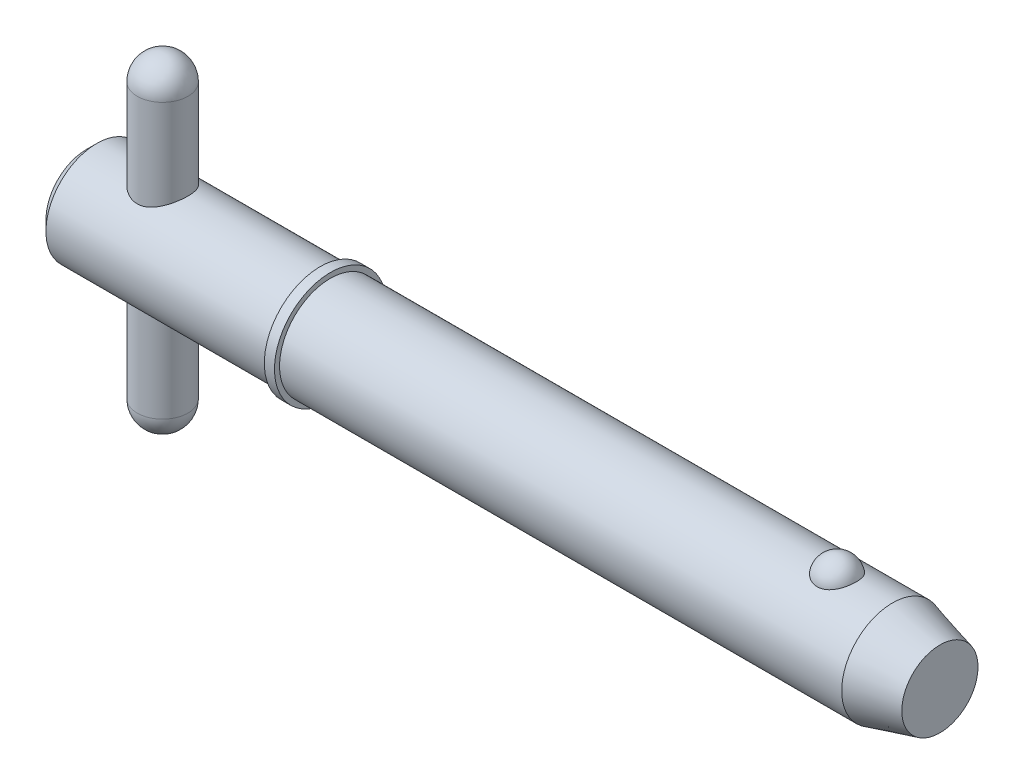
ISO-10303-21;
HEADER;
FILE_DESCRIPTION(('STEP AP214'),'2;1');
FILE_NAME('part.step','',(''),(''),'','','');
FILE_SCHEMA(('AUTOMOTIVE_DESIGN { 1 0 10303 214 1 1 1 1 }'));
ENDSEC;
DATA;
#1=APPLICATION_CONTEXT('core data for automotive mechanical design processes');
#2=APPLICATION_PROTOCOL_DEFINITION('international standard','automotive_design',2000,#1);
#3=PRODUCT_CONTEXT('',#1,'mechanical');
#4=PRODUCT('Part','Part','',(#3));
#5=PRODUCT_RELATED_PRODUCT_CATEGORY('part','',(#4));
#6=PRODUCT_DEFINITION_FORMATION('','',#4);
#7=PRODUCT_DEFINITION_CONTEXT('part definition',#1,'design');
#8=PRODUCT_DEFINITION('design','',#6,#7);
#9=PRODUCT_DEFINITION_SHAPE('','',#8);
#10=(LENGTH_UNIT() NAMED_UNIT(*) SI_UNIT(.MILLI.,.METRE.));
#11=(NAMED_UNIT(*) PLANE_ANGLE_UNIT() SI_UNIT($,.RADIAN.));
#12=(NAMED_UNIT(*) SI_UNIT($,.STERADIAN.) SOLID_ANGLE_UNIT());
#13=UNCERTAINTY_MEASURE_WITH_UNIT(LENGTH_MEASURE(1.E-05),#10,'distance_accuracy_value','');
#14=(GEOMETRIC_REPRESENTATION_CONTEXT(3) GLOBAL_UNCERTAINTY_ASSIGNED_CONTEXT((#13)) GLOBAL_UNIT_ASSIGNED_CONTEXT((#10,
#11,#12)) REPRESENTATION_CONTEXT('',''));
#15=CARTESIAN_POINT('',(0.,0.,0.));
#16=DIRECTION('',(0.,0.,1.));
#17=DIRECTION('',(1.,0.,0.));
#18=AXIS2_PLACEMENT_3D('',#15,#16,#17);
#19=CARTESIAN_POINT('',(5.94,12.7,0.));
#20=DIRECTION('',(0.,-1.,0.));
#21=DIRECTION('',(0.,0.,-1.));
#22=AXIS2_PLACEMENT_3D('',#19,#20,#21);
#23=CYLINDRICAL_SURFACE('',#22,1.98);
#24=CARTESIAN_POINT('',(5.94,-10.72,0.));
#25=DIRECTION('',(0.,-1.,0.));
#26=DIRECTION('',(0.,0.,-1.));
#27=AXIS2_PLACEMENT_3D('',#24,#25,#26);
#28=CIRCLE('',#27,1.98);
#29=CARTESIAN_POINT('',(5.94,-10.72,-1.98));
#30=VERTEX_POINT('',#29);
#31=EDGE_CURVE('P0_E10',#30,#30,#28,.F.);
#32=ORIENTED_EDGE('',*,*,#31,.T.);
#33=EDGE_LOOP('',(#32));
#34=FACE_BOUND('',#33,.T.);
#35=CARTESIAN_POINT('',(5.94,10.72,0.));
#36=DIRECTION('',(0.,-1.,0.));
#37=DIRECTION('',(0.,0.,-1.));
#38=AXIS2_PLACEMENT_3D('',#35,#36,#37);
#39=CIRCLE('',#38,1.98);
#40=CARTESIAN_POINT('',(5.94,10.72,-1.98));
#41=VERTEX_POINT('',#40);
#42=EDGE_CURVE('P0_E21',#41,#41,#39,.T.);
#43=ORIENTED_EDGE('',*,*,#42,.T.);
#44=EDGE_LOOP('',(#43));
#45=FACE_BOUND('',#44,.T.);
#46=ADVANCED_FACE('P0_F14',(#34,#45),#23,.T.);
#47=CARTESIAN_POINT('',(5.94,-10.72,0.));
#48=DIRECTION('',(0.,0.,1.));
#49=DIRECTION('',(1.,0.,0.));
#50=AXIS2_PLACEMENT_3D('',#47,#48,#49);
#51=SPHERICAL_SURFACE('',#50,1.98);
#52=CARTESIAN_POINT('',(5.94,-10.72,0.));
#53=DIRECTION('',(0.,-1.,0.));
#54=DIRECTION('',(0.,0.,-1.));
#55=AXIS2_PLACEMENT_3D('',#52,#53,#54);
#56=SPHERICAL_SURFACE('',#55,1.98);
#57=ORIENTED_EDGE('',*,*,#31,.F.);
#58=EDGE_LOOP('',(#57));
#59=FACE_BOUND('',#58,.T.);
#60=ADVANCED_FACE('P0_F29',(#59),#56,.T.);
#61=CARTESIAN_POINT('',(5.94,10.72,0.));
#62=DIRECTION('',(0.,0.,1.));
#63=DIRECTION('',(1.,0.,0.));
#64=AXIS2_PLACEMENT_3D('',#61,#62,#63);
#65=SPHERICAL_SURFACE('',#64,1.98);
#66=CARTESIAN_POINT('',(5.94,10.72,0.));
#67=DIRECTION('',(0.,-1.,0.));
#68=DIRECTION('',(0.,0.,-1.));
#69=AXIS2_PLACEMENT_3D('',#66,#67,#68);
#70=SPHERICAL_SURFACE('',#69,1.98);
#71=ORIENTED_EDGE('',*,*,#42,.F.);
#72=EDGE_LOOP('',(#71));
#73=FACE_BOUND('',#72,.T.);
#74=ADVANCED_FACE('P0_F16',(#73),#70,.T.);
#75=CLOSED_SHELL('',(#46,#60,#74));
#76=MANIFOLD_SOLID_BREP('P0_B1',#75);
#77=CARTESIAN_POINT('',(0.,0.,0.));
#78=DIRECTION('',(1.,0.,0.));
#79=DIRECTION('',(0.,0.,-1.));
#80=AXIS2_PLACEMENT_3D('',#77,#78,#79);
#81=CYLINDRICAL_SURFACE('',#80,3.97);
#82=CARTESIAN_POINT('',(62.9759395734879,0.,0.));
#83=DIRECTION('',(1.,0.,0.));
#84=DIRECTION('',(0.,0.,-1.));
#85=AXIS2_PLACEMENT_3D('',#82,#83,#84);
#86=CIRCLE('',#85,3.97);
#87=CARTESIAN_POINT('',(62.9759395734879,0.,-3.97));
#88=VERTEX_POINT('',#87);
#89=EDGE_CURVE('P1_E81',#88,#88,#86,.T.);
#90=ORIENTED_EDGE('',*,*,#89,.F.);
#91=EDGE_LOOP('',(#90));
#92=FACE_BOUND('',#91,.T.);
#93=CARTESIAN_POINT('',(19.05,0.,0.));
#94=DIRECTION('',(1.,0.,0.));
#95=DIRECTION('',(0.,0.,-1.));
#96=AXIS2_PLACEMENT_3D('',#93,#94,#95);
#97=CIRCLE('',#96,3.97);
#98=CARTESIAN_POINT('',(19.05,0.,-3.97));
#99=VERTEX_POINT('',#98);
#100=EDGE_CURVE('P1_E85',#99,#99,#97,.T.);
#101=ORIENTED_EDGE('',*,*,#100,.T.);
#102=EDGE_LOOP('',(#101));
#103=FACE_BOUND('',#102,.T.);
#104=CARTESIAN_POINT('',(58.6451922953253,3.65715365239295,1.54470941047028));
#105=CARTESIAN_POINT('',(58.5652448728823,3.65716001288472,1.54470290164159));
#106=CARTESIAN_POINT('',(58.4851650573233,3.65987074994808,1.53832549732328));
#107=CARTESIAN_POINT('',(58.3272374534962,3.6704221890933,1.51297018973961));
#108=CARTESIAN_POINT('',(58.2493961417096,3.67827646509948,1.49395894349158));
#109=CARTESIAN_POINT('',(58.0984614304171,3.69818848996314,1.44395950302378));
#110=CARTESIAN_POINT('',(58.0253560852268,3.71023513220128,1.41300293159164));
#111=CARTESIAN_POINT('',(57.8855630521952,3.7372183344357,1.34000212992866));
#112=CARTESIAN_POINT('',(57.8188725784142,3.75215363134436,1.29796274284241));
#113=CARTESIAN_POINT('',(57.6914886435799,3.78384968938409,1.20248834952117));
#114=CARTESIAN_POINT('',(57.6310299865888,3.80065129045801,1.14875388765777));
#115=CARTESIAN_POINT('',(57.5196942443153,3.83398532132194,1.03205417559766));
#116=CARTESIAN_POINT('',(57.4688200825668,3.85051766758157,0.969086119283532));
#117=CARTESIAN_POINT('',(57.3756321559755,3.88238608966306,0.832526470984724));
#118=CARTESIAN_POINT('',(57.3337961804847,3.89763698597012,0.758588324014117));
#119=CARTESIAN_POINT('',(57.2625108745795,3.92451063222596,0.604352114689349));
#120=CARTESIAN_POINT('',(57.2330623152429,3.93613315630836,0.524053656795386));
#121=CARTESIAN_POINT('',(57.1868927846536,3.95467606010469,0.358403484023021));
#122=CARTESIAN_POINT('',(57.1703127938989,3.96154426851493,0.273006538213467));
#123=CARTESIAN_POINT('',(57.150756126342,3.96967008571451,0.100408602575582));
#124=CARTESIAN_POINT('',(57.1477789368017,3.97092790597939,0.0132076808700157));
#125=CARTESIAN_POINT('',(57.1554587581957,3.96771794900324,-0.159844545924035));
#126=CARTESIAN_POINT('',(57.1660164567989,3.96329187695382,-0.245701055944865));
#127=CARTESIAN_POINT('',(57.2003800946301,3.94923163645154,-0.414277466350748));
#128=CARTESIAN_POINT('',(57.2241862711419,3.93959737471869,-0.496997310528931));
#129=CARTESIAN_POINT('',(57.2846114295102,3.91607752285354,-0.657113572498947));
#130=CARTESIAN_POINT('',(57.3212495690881,3.90218558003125,-0.734501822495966));
#131=CARTESIAN_POINT('',(57.4065935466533,3.87158287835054,-0.881704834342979));
#132=CARTESIAN_POINT('',(57.4553004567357,3.8548718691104,-0.951518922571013));
#133=CARTESIAN_POINT('',(57.5641161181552,3.82028735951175,-1.08208159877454));
#134=CARTESIAN_POINT('',(57.6242955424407,3.80240713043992,-1.14276958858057));
#135=CARTESIAN_POINT('',(57.754493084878,3.76758161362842,-1.2528243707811));
#136=CARTESIAN_POINT('',(57.8245105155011,3.75063626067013,-1.30219195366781));
#137=CARTESIAN_POINT('',(57.97118160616,3.71998948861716,-1.38729709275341));
#138=CARTESIAN_POINT('',(58.0476813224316,3.70623183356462,-1.42327904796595));
#139=CARTESIAN_POINT('',(58.2062981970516,3.68323188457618,-1.48178996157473));
#140=CARTESIAN_POINT('',(58.2884132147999,3.67398788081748,-1.5043240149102));
#141=CARTESIAN_POINT('',(58.4514810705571,3.6615216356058,-1.53440939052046));
#142=CARTESIAN_POINT('',(58.5322840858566,3.65801951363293,-1.54265826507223));
#143=CARTESIAN_POINT('',(58.6942085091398,3.65657341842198,-1.5460842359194));
#144=CARTESIAN_POINT('',(58.7753298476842,3.65862829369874,-1.54126404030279));
#145=CARTESIAN_POINT('',(58.9328122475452,3.66788969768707,-1.51908474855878));
#146=CARTESIAN_POINT('',(59.0092422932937,3.67492621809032,-1.50213925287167));
#147=CARTESIAN_POINT('',(59.1580412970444,3.69318404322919,-1.45666982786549));
#148=CARTESIAN_POINT('',(59.2304099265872,3.70440568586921,-1.42814496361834));
#149=CARTESIAN_POINT('',(59.3708029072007,3.73012749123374,-1.35956319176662));
#150=CARTESIAN_POINT('',(59.4387000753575,3.74469307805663,-1.31927107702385));
#151=CARTESIAN_POINT('',(59.5668649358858,3.77545272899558,-1.22847440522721));
#152=CARTESIAN_POINT('',(59.6271308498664,3.79164717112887,-1.17796747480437));
#153=CARTESIAN_POINT('',(59.7416346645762,3.82490325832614,-1.06519260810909));
#154=CARTESIAN_POINT('',(59.7954137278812,3.84196735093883,-1.00245914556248));
#155=CARTESIAN_POINT('',(59.8920988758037,3.87439863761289,-0.86871586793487));
#156=CARTESIAN_POINT('',(59.9350030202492,3.88976552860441,-0.797704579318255));
#157=CARTESIAN_POINT('',(60.010266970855,3.91771381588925,-0.646896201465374));
#158=CARTESIAN_POINT('',(60.0422532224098,3.93019255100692,-0.566893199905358));
#159=CARTESIAN_POINT('',(60.0931101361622,3.95043886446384,-0.402255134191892));
#160=CARTESIAN_POINT('',(60.1119807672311,3.95820643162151,-0.317620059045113));
#161=CARTESIAN_POINT('',(60.1362162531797,3.96823733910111,-0.146156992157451));
#162=CARTESIAN_POINT('',(60.1415874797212,3.970503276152,-0.0593300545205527));
#163=CARTESIAN_POINT('',(60.1387309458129,3.96930811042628,0.114057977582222));
#164=CARTESIAN_POINT('',(60.130503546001,3.9658471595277,0.200619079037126));
#165=CARTESIAN_POINT('',(60.1007063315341,3.95358562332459,0.370506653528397));
#166=CARTESIAN_POINT('',(60.0792129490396,3.94481563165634,0.453848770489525));
#167=CARTESIAN_POINT('',(60.0233839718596,3.92284586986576,0.615497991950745));
#168=CARTESIAN_POINT('',(59.9890474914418,3.90964579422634,0.69380474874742));
#169=CARTESIAN_POINT('',(59.9079702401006,3.88006987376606,0.843703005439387));
#170=CARTESIAN_POINT('',(59.8611536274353,3.86367478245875,0.915249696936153));
#171=CARTESIAN_POINT('',(59.7561897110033,3.82949741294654,1.04910810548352));
#172=CARTESIAN_POINT('',(59.6980428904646,3.81171519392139,1.11142021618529));
#173=CARTESIAN_POINT('',(59.5717433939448,3.77673366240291,1.22503948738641));
#174=CARTESIAN_POINT('',(59.5035970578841,3.75953398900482,1.27635357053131));
#175=CARTESIAN_POINT('',(59.3589009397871,3.72770506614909,1.36653336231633));
#176=CARTESIAN_POINT('',(59.282348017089,3.71307678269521,1.40539439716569));
#177=CARTESIAN_POINT('',(59.1257594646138,3.68864287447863,1.46830480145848));
#178=CARTESIAN_POINT('',(59.0459307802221,3.67869017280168,1.49281289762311));
#179=CARTESIAN_POINT('',(58.8829877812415,3.66414535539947,1.52817474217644));
#180=CARTESIAN_POINT('',(58.7998840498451,3.65953723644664,1.53906926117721));
#181=CARTESIAN_POINT('',(58.6927760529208,3.6573894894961,1.54414878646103));
#182=CARTESIAN_POINT('',(58.6689900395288,3.65715175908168,1.54471134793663));
#183=CARTESIAN_POINT('',(58.6451922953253,3.65715365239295,1.54470941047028));
#184=B_SPLINE_CURVE_WITH_KNOTS('',3,(#104,#105,#106,#107,#108,#109,#110,#111,#112,#113,#114,
#115,#116,#117,#118,#119,#120,#121,#122,#123,#124,#125,#126,#127,#128,#129,#130,#131,#132,#133,
#134,#135,#136,#137,#138,#139,#140,#141,#142,#143,#144,#145,#146,#147,#148,#149,#150,#151,#152,
#153,#154,#155,#156,#157,#158,#159,#160,#161,#162,#163,#164,#165,#166,#167,#168,#169,#170,#171,
#172,#173,#174,#175,#176,#177,#178,#179,#180,#181,#182,#183),.UNSPECIFIED.,.T.,.F.,(4,2,2,2,2,2,
2,2,2,2,2,2,2,2,2,2,2,2,2,2,2,2,2,2,2,2,2,2,2,2,2,2,2,2,2,2,2,2,2,4),(0.,0.239777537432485,
0.480190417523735,0.719971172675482,0.959647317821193,1.20639040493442,1.45320863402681,
1.7109367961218,1.96868099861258,2.22921052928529,2.48973023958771,2.74834928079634,
3.00697295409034,3.26598440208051,3.52501886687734,3.78570385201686,4.04637062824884,
4.30201257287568,4.55755760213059,4.80022994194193,5.04285200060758,5.27757006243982,
5.51230707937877,5.75210128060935,5.99195126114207,6.24392810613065,6.49594987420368,
6.75588818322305,7.01582710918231,7.27564332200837,7.53545264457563,7.79377886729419,
8.0521229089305,8.31207418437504,8.57201437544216,8.83179046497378,9.09166393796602,
9.34270057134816,9.59298357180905,9.66435753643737),.UNSPECIFIED.);
#185=CARTESIAN_POINT('',(58.6451922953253,3.65715365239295,1.54470941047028));
#186=VERTEX_POINT('',#185);
#187=EDGE_CURVE('P1_E35',#186,#186,#184,.T.);
#188=ORIENTED_EDGE('',*,*,#187,.T.);
#189=EDGE_LOOP('',(#188));
#190=FACE_BOUND('',#189,.T.);
#191=ADVANCED_FACE('P1_F13',(#92,#103,#190),#81,.T.);
#192=CARTESIAN_POINT('',(0.,0.,0.));
#193=DIRECTION('',(-1.,0.,0.));
#194=DIRECTION('',(0.,0.,1.));
#195=AXIS2_PLACEMENT_3D('',#192,#193,#194);
#196=PLANE('',#195);
#197=CARTESIAN_POINT('',(0.,0.,0.));
#198=DIRECTION('',(1.,0.,0.));
#199=DIRECTION('',(0.,0.,-1.));
#200=AXIS2_PLACEMENT_3D('',#197,#198,#199);
#201=CIRCLE('',#200,3.176);
#202=CARTESIAN_POINT('',(0.,0.,-3.176));
#203=VERTEX_POINT('',#202);
#204=EDGE_CURVE('P1_E9',#203,#203,#201,.T.);
#205=ORIENTED_EDGE('',*,*,#204,.F.);
#206=EDGE_LOOP('',(#205));
#207=FACE_BOUND('',#206,.T.);
#208=ADVANCED_FACE('P1_F15',(#207),#196,.T.);
#209=CARTESIAN_POINT('',(0.793999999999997,0.,0.));
#210=DIRECTION('',(1.,0.,0.));
#211=DIRECTION('',(0.,0.,-1.));
#212=AXIS2_PLACEMENT_3D('',#209,#210,#211);
#213=CONICAL_SURFACE('',#212,3.97,0.78539816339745);
#214=ORIENTED_EDGE('',*,*,#204,.T.);
#215=EDGE_LOOP('',(#214));
#216=FACE_BOUND('',#215,.T.);
#217=CARTESIAN_POINT('',(0.793999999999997,0.,0.));
#218=DIRECTION('',(1.,0.,0.));
#219=DIRECTION('',(0.,0.,-1.));
#220=AXIS2_PLACEMENT_3D('',#217,#218,#219);
#221=CIRCLE('',#220,3.97);
#222=CARTESIAN_POINT('',(0.793999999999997,0.,-3.97));
#223=VERTEX_POINT('',#222);
#224=EDGE_CURVE('P1_E26',#223,#223,#221,.T.);
#225=ORIENTED_EDGE('',*,*,#224,.F.);
#226=EDGE_LOOP('',(#225));
#227=FACE_BOUND('',#226,.T.);
#228=ADVANCED_FACE('P1_F77',(#216,#227),#213,.T.);
#229=CARTESIAN_POINT('',(0.,0.,0.));
#230=DIRECTION('',(1.,0.,0.));
#231=DIRECTION('',(0.,0.,-1.));
#232=AXIS2_PLACEMENT_3D('',#229,#230,#231);
#233=CYLINDRICAL_SURFACE('',#232,3.97);
#234=CARTESIAN_POINT('',(5.94,-3.44100276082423,1.98));
#235=CARTESIAN_POINT('',(5.8367885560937,-3.44101282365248,1.97999171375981));
#236=CARTESIAN_POINT('',(5.73344176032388,-3.44571749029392,1.97187534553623));
#237=CARTESIAN_POINT('',(5.52991905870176,-3.46385873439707,1.93981946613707));
#238=CARTESIAN_POINT('',(5.42975031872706,-3.47731375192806,1.91584653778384));
#239=CARTESIAN_POINT('',(5.23590869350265,-3.51100678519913,1.85336773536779));
#240=CARTESIAN_POINT('',(5.14220446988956,-3.53120882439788,1.81493880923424));
#241=CARTESIAN_POINT('',(4.9625969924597,-3.57606420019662,1.72487335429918));
#242=CARTESIAN_POINT('',(4.87669412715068,-3.6007177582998,1.67323616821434));
#243=CARTESIAN_POINT('',(4.70734412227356,-3.65417020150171,1.55325205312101));
#244=CARTESIAN_POINT('',(4.62467662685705,-3.68314323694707,1.4838818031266));
#245=CARTESIAN_POINT('',(4.47154355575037,-3.74056406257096,1.33252902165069));
#246=CARTESIAN_POINT('',(4.40108404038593,-3.76901158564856,1.25054026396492));
#247=CARTESIAN_POINT('',(4.26974803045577,-3.82445556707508,1.06956584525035));
#248=CARTESIAN_POINT('',(4.20982960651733,-3.8512271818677,0.969809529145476));
#249=CARTESIAN_POINT('',(4.10798077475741,-3.89804342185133,0.760047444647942));
#250=CARTESIAN_POINT('',(4.06603907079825,-3.91809226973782,0.650048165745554));
#251=CARTESIAN_POINT('',(4.00441878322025,-3.94794912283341,0.431181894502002));
#252=CARTESIAN_POINT('',(3.98337329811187,-3.95838209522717,0.322786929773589));
#253=CARTESIAN_POINT('',(3.9596425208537,-3.97016407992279,0.103541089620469));
#254=CARTESIAN_POINT('',(3.95694618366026,-3.97151855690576,-0.00730826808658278));
#255=CARTESIAN_POINT('',(3.9694599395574,-3.96528826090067,-0.218044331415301));
#256=CARTESIAN_POINT('',(3.98314071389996,-3.95846689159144,-0.318049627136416));
#257=CARTESIAN_POINT('',(4.02528522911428,-3.93780347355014,-0.514124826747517));
#258=CARTESIAN_POINT('',(4.05375007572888,-3.92396089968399,-0.61019443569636));
#259=CARTESIAN_POINT('',(4.12484256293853,-3.89028355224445,-0.797351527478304));
#260=CARTESIAN_POINT('',(4.16766142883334,-3.87036821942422,-0.888351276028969));
#261=CARTESIAN_POINT('',(4.26598377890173,-3.82634285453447,-1.06209448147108));
#262=CARTESIAN_POINT('',(4.32149181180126,-3.8022313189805,-1.14483496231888));
#263=CARTESIAN_POINT('',(4.44962332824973,-3.74940011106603,-1.30802500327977));
#264=CARTESIAN_POINT('',(4.52336636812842,-3.72046031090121,-1.38752498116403));
#265=CARTESIAN_POINT('',(4.68287656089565,-3.66269463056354,-1.53354043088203));
#266=CARTESIAN_POINT('',(4.7686527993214,-3.63386885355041,-1.60004599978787));
#267=CARTESIAN_POINT('',(4.9564069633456,-3.57763161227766,-1.72228426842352));
#268=CARTESIAN_POINT('',(5.05906485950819,-3.5504233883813,-1.77707534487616));
#269=CARTESIAN_POINT('',(5.27381412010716,-3.50334038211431,-1.86819784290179));
#270=CARTESIAN_POINT('',(5.38589553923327,-3.48345798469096,-1.90454844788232));
#271=CARTESIAN_POINT('',(5.6069795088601,-3.45548331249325,-1.95481643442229));
#272=CARTESIAN_POINT('',(5.71552407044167,-3.44658268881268,-1.97028113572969));
#273=CARTESIAN_POINT('',(5.93399639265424,-3.43928114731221,-1.98300600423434));
#274=CARTESIAN_POINT('',(6.04392313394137,-3.44087289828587,-1.98027888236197));
#275=CARTESIAN_POINT('',(6.24931618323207,-3.45351901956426,-1.95811780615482));
#276=CARTESIAN_POINT('',(6.34505668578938,-3.46352725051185,-1.94052989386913));
#277=CARTESIAN_POINT('',(6.53204702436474,-3.49033612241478,-1.89188242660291));
#278=CARTESIAN_POINT('',(6.62329540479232,-3.50713894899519,-1.86081853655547));
#279=CARTESIAN_POINT('',(6.80352105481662,-3.54655680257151,-1.78458666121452));
#280=CARTESIAN_POINT('',(6.89219712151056,-3.56940508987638,-1.73883178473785));
#281=CARTESIAN_POINT('',(7.06112449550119,-3.61813012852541,-1.63502913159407));
#282=CARTESIAN_POINT('',(7.14137144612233,-3.6440084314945,-1.57697504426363));
#283=CARTESIAN_POINT('',(7.30168083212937,-3.69977514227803,-1.44171920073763));
#284=CARTESIAN_POINT('',(7.38046039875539,-3.7297597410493,-1.36302972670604));
#285=CARTESIAN_POINT('',(7.52409649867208,-3.78754991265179,-1.19307190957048));
#286=CARTESIAN_POINT('',(7.58894840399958,-3.81535475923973,-1.10179940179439));
#287=CARTESIAN_POINT('',(7.70430122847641,-3.86658972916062,-0.906019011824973));
#288=CARTESIAN_POINT('',(7.75438714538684,-3.88988795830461,-0.801229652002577));
#289=CARTESIAN_POINT('',(7.83572184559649,-3.92848199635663,-0.583216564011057));
#290=CARTESIAN_POINT('',(7.86698708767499,-3.94378479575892,-0.470000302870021));
#291=CARTESIAN_POINT('',(7.90711051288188,-3.96355307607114,-0.249525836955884));
#292=CARTESIAN_POINT('',(7.91775648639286,-3.96888171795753,-0.142669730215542));
#293=CARTESIAN_POINT('',(7.92160247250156,-3.97079858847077,0.0714191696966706));
#294=CARTESIAN_POINT('',(7.91480852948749,-3.96738984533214,0.178651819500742));
#295=CARTESIAN_POINT('',(7.88515479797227,-3.9527181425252,0.383072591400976));
#296=CARTESIAN_POINT('',(7.8633739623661,-3.94198303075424,0.480459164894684));
#297=CARTESIAN_POINT('',(7.80581513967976,-3.91422178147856,0.670038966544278));
#298=CARTESIAN_POINT('',(7.77003513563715,-3.89719473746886,0.762231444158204));
#299=CARTESIAN_POINT('',(7.68389191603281,-3.85747818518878,0.943248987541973));
#300=CARTESIAN_POINT('',(7.63296879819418,-3.83457704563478,1.03175978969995));
#301=CARTESIAN_POINT('',(7.51869140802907,-3.7855122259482,1.19934744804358));
#302=CARTESIAN_POINT('',(7.45533142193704,-3.75934704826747,1.2784199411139));
#303=CARTESIAN_POINT('',(7.31068939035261,-3.70329841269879,1.433144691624));
#304=CARTESIAN_POINT('',(7.22825362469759,-3.67330340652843,1.50768183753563));
#305=CARTESIAN_POINT('',(7.05162367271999,-3.61514025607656,1.64226879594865));
#306=CARTESIAN_POINT('',(6.95741928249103,-3.58697372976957,1.70230590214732));
#307=CARTESIAN_POINT('',(6.75590859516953,-3.53504049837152,1.80775364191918));
#308=CARTESIAN_POINT('',(6.64828786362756,-3.51143624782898,1.85265616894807));
#309=CARTESIAN_POINT('',(6.48137774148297,-3.48289659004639,1.90544537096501));
#310=CARTESIAN_POINT('',(6.42488151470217,-3.4745323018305,1.9206071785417));
#311=CARTESIAN_POINT('',(6.31046920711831,-3.4604244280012,1.94591259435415));
#312=CARTESIAN_POINT('',(6.25255415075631,-3.45467900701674,1.95605971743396));
#313=CARTESIAN_POINT('',(6.1521444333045,-3.44728060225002,1.96905939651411));
#314=CARTESIAN_POINT('',(6.10985721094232,-3.44493297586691,1.97315742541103));
#315=CARTESIAN_POINT('',(6.02505433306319,-3.44179192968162,1.97862952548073));
#316=CARTESIAN_POINT('',(5.98253866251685,-3.44099861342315,1.98000341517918));
#317=CARTESIAN_POINT('',(5.94,-3.44100276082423,1.98));
#318=B_SPLINE_CURVE_WITH_KNOTS('',3,(#234,#235,#236,#237,#238,#239,#240,#241,#242,#243,#244,
#245,#246,#247,#248,#249,#250,#251,#252,#253,#254,#255,#256,#257,#258,#259,#260,#261,#262,#263,
#264,#265,#266,#267,#268,#269,#270,#271,#272,#273,#274,#275,#276,#277,#278,#279,#280,#281,#282,
#283,#284,#285,#286,#287,#288,#289,#290,#291,#292,#293,#294,#295,#296,#297,#298,#299,#300,#301,
#302,#303,#304,#305,#306,#307,#308,#309,#310,#311,#312,#313,#314,#315,#316,#317),.UNSPECIFIED.,
.T.,.F.,(4,2,2,2,2,2,2,2,2,2,2,2,2,2,2,2,2,2,2,2,2,2,2,2,2,2,2,2,2,2,2,2,2,2,2,2,2,2,2,2,2,4),
(0.,0.309462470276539,0.619579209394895,0.928068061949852,1.23657226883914,1.57038619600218,
1.90436536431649,2.26071614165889,2.61684266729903,2.94773555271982,3.27842924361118,
3.58050679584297,3.88260694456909,4.18890317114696,4.49530936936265,4.83057163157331,
5.1660884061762,5.52272472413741,5.87898927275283,6.20706708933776,6.53491569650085,
6.82716910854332,7.11951660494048,7.42541184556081,7.73146442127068,8.07586334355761,
8.42037652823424,8.77380887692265,9.12693169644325,9.44775848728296,9.76847409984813,
10.0682302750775,10.3680296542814,10.6806938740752,10.9935020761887,11.3373031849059,
11.6814044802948,12.0361164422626,12.2131519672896,12.3900632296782,12.5175998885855,
12.6451450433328),.UNSPECIFIED.);
#319=CARTESIAN_POINT('',(5.94,-3.44100276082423,1.98));
#320=VERTEX_POINT('',#319);
#321=EDGE_CURVE('P1_E17',#320,#320,#318,.T.);
#322=ORIENTED_EDGE('',*,*,#321,.F.);
#323=EDGE_LOOP('',(#322));
#324=FACE_BOUND('',#323,.T.);
#325=CARTESIAN_POINT('',(5.94,3.44100276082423,1.98));
#326=CARTESIAN_POINT('',(6.0432114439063,3.44101282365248,1.97999171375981));
#327=CARTESIAN_POINT('',(6.14655823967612,3.44571749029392,1.97187534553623));
#328=CARTESIAN_POINT('',(6.35008094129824,3.46385873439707,1.93981946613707));
#329=CARTESIAN_POINT('',(6.45024968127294,3.47731375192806,1.91584653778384));
#330=CARTESIAN_POINT('',(6.64409130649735,3.51100678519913,1.85336773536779));
#331=CARTESIAN_POINT('',(6.73779553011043,3.53120882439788,1.81493880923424));
#332=CARTESIAN_POINT('',(6.91740300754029,3.57606420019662,1.72487335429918));
#333=CARTESIAN_POINT('',(7.00330587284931,3.6007177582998,1.67323616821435));
#334=CARTESIAN_POINT('',(7.17265587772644,3.65417020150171,1.55325205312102));
#335=CARTESIAN_POINT('',(7.25532337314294,3.68314323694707,1.4838818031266));
#336=CARTESIAN_POINT('',(7.40845644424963,3.74056406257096,1.3325290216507));
#337=CARTESIAN_POINT('',(7.47891595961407,3.76901158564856,1.25054026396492));
#338=CARTESIAN_POINT('',(7.61025196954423,3.82445556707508,1.06956584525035));
#339=CARTESIAN_POINT('',(7.67017039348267,3.8512271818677,0.969809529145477));
#340=CARTESIAN_POINT('',(7.77201922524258,3.89804342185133,0.760047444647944));
#341=CARTESIAN_POINT('',(7.81396092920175,3.91809226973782,0.650048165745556));
#342=CARTESIAN_POINT('',(7.87558121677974,3.94794912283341,0.431181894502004));
#343=CARTESIAN_POINT('',(7.89662670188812,3.95838209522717,0.322786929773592));
#344=CARTESIAN_POINT('',(7.9203574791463,3.97016407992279,0.103541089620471));
#345=CARTESIAN_POINT('',(7.92305381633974,3.97151855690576,-0.00730826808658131));
#346=CARTESIAN_POINT('',(7.9105400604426,3.96528826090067,-0.2180443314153));
#347=CARTESIAN_POINT('',(7.89685928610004,3.95846689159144,-0.318049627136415));
#348=CARTESIAN_POINT('',(7.85471477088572,3.93780347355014,-0.514124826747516));
#349=CARTESIAN_POINT('',(7.82624992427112,3.92396089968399,-0.61019443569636));
#350=CARTESIAN_POINT('',(7.75515743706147,3.89028355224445,-0.797351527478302));
#351=CARTESIAN_POINT('',(7.71233857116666,3.87036821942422,-0.888351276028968));
#352=CARTESIAN_POINT('',(7.61401622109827,3.82634285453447,-1.06209448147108));
#353=CARTESIAN_POINT('',(7.55850818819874,3.8022313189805,-1.14483496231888));
#354=CARTESIAN_POINT('',(7.43037667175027,3.74940011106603,-1.30802500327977));
#355=CARTESIAN_POINT('',(7.35663363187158,3.72046031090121,-1.38752498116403));
#356=CARTESIAN_POINT('',(7.19712343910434,3.66269463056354,-1.53354043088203));
#357=CARTESIAN_POINT('',(7.1113472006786,3.63386885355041,-1.60004599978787));
#358=CARTESIAN_POINT('',(6.9235930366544,3.57763161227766,-1.72228426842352));
#359=CARTESIAN_POINT('',(6.82093514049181,3.5504233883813,-1.77707534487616));
#360=CARTESIAN_POINT('',(6.60618587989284,3.50334038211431,-1.86819784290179));
#361=CARTESIAN_POINT('',(6.49410446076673,3.48345798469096,-1.90454844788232));
#362=CARTESIAN_POINT('',(6.2730204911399,3.45548331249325,-1.95481643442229));
#363=CARTESIAN_POINT('',(6.16447592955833,3.44658268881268,-1.97028113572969));
#364=CARTESIAN_POINT('',(5.94600360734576,3.43928114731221,-1.98300600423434));
#365=CARTESIAN_POINT('',(5.83607686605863,3.44087289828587,-1.98027888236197));
#366=CARTESIAN_POINT('',(5.63068381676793,3.45351901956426,-1.95811780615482));
#367=CARTESIAN_POINT('',(5.53494331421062,3.46352725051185,-1.94052989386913));
#368=CARTESIAN_POINT('',(5.34795297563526,3.49033612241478,-1.89188242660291));
#369=CARTESIAN_POINT('',(5.25670459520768,3.50713894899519,-1.86081853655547));
#370=CARTESIAN_POINT('',(5.07647894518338,3.54655680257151,-1.78458666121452));
#371=CARTESIAN_POINT('',(4.98780287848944,3.56940508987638,-1.73883178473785));
#372=CARTESIAN_POINT('',(4.81887550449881,3.61813012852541,-1.63502913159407));
#373=CARTESIAN_POINT('',(4.73862855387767,3.6440084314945,-1.57697504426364));
#374=CARTESIAN_POINT('',(4.57831916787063,3.69977514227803,-1.44171920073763));
#375=CARTESIAN_POINT('',(4.49953960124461,3.7297597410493,-1.36302972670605));
#376=CARTESIAN_POINT('',(4.35590350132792,3.78754991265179,-1.19307190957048));
#377=CARTESIAN_POINT('',(4.29105159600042,3.81535475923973,-1.10179940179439));
#378=CARTESIAN_POINT('',(4.17569877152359,3.86658972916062,-0.906019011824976));
#379=CARTESIAN_POINT('',(4.12561285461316,3.88988795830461,-0.80122965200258));
#380=CARTESIAN_POINT('',(4.04427815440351,3.92848199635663,-0.58321656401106));
#381=CARTESIAN_POINT('',(4.01301291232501,3.94378479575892,-0.470000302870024));
#382=CARTESIAN_POINT('',(3.97288948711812,3.96355307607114,-0.249525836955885));
#383=CARTESIAN_POINT('',(3.96224351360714,3.96888171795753,-0.142669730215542));
#384=CARTESIAN_POINT('',(3.95839752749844,3.97079858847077,0.0714191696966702));
#385=CARTESIAN_POINT('',(3.96519147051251,3.96738984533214,0.178651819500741));
#386=CARTESIAN_POINT('',(3.99484520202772,3.9527181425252,0.383072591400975));
#387=CARTESIAN_POINT('',(4.01662603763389,3.94198303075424,0.480459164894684));
#388=CARTESIAN_POINT('',(4.07418486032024,3.91422178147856,0.670038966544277));
#389=CARTESIAN_POINT('',(4.10996486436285,3.89719473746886,0.762231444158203));
#390=CARTESIAN_POINT('',(4.19610808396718,3.85747818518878,0.943248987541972));
#391=CARTESIAN_POINT('',(4.24703120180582,3.83457704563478,1.03175978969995));
#392=CARTESIAN_POINT('',(4.36130859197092,3.7855122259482,1.19934744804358));
#393=CARTESIAN_POINT('',(4.42466857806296,3.75934704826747,1.2784199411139));
#394=CARTESIAN_POINT('',(4.56931060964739,3.70329841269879,1.433144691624));
#395=CARTESIAN_POINT('',(4.65174637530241,3.67330340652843,1.50768183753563));
#396=CARTESIAN_POINT('',(4.82837632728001,3.61514025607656,1.64226879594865));
#397=CARTESIAN_POINT('',(4.92258071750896,3.58697372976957,1.70230590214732));
#398=CARTESIAN_POINT('',(5.12409140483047,3.53504049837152,1.80775364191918));
#399=CARTESIAN_POINT('',(5.23171213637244,3.51143624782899,1.85265616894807));
#400=CARTESIAN_POINT('',(5.39862225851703,3.48289659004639,1.90544537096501));
#401=CARTESIAN_POINT('',(5.45511848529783,3.4745323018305,1.9206071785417));
#402=CARTESIAN_POINT('',(5.56953079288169,3.4604244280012,1.94591259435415));
#403=CARTESIAN_POINT('',(5.62744584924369,3.45467900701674,1.95605971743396));
#404=CARTESIAN_POINT('',(5.7278555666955,3.44728060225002,1.9690593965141));
#405=CARTESIAN_POINT('',(5.77014278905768,3.44493297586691,1.97315742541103));
#406=CARTESIAN_POINT('',(5.85494566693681,3.44179192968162,1.97862952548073));
#407=CARTESIAN_POINT('',(5.89746133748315,3.44099861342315,1.98000341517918));
#408=CARTESIAN_POINT('',(5.94,3.44100276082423,1.98));
#409=B_SPLINE_CURVE_WITH_KNOTS('',3,(#325,#326,#327,#328,#329,#330,#331,#332,#333,#334,#335,
#336,#337,#338,#339,#340,#341,#342,#343,#344,#345,#346,#347,#348,#349,#350,#351,#352,#353,#354,
#355,#356,#357,#358,#359,#360,#361,#362,#363,#364,#365,#366,#367,#368,#369,#370,#371,#372,#373,
#374,#375,#376,#377,#378,#379,#380,#381,#382,#383,#384,#385,#386,#387,#388,#389,#390,#391,#392,
#393,#394,#395,#396,#397,#398,#399,#400,#401,#402,#403,#404,#405,#406,#407,#408),.UNSPECIFIED.,
.T.,.F.,(4,2,2,2,2,2,2,2,2,2,2,2,2,2,2,2,2,2,2,2,2,2,2,2,2,2,2,2,2,2,2,2,2,2,2,2,2,2,2,2,2,4),
(0.,0.309462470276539,0.619579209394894,0.928068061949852,1.23657226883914,1.57038619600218,
1.90436536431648,2.26071614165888,2.61684266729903,2.94773555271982,3.27842924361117,
3.58050679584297,3.88260694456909,4.18890317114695,4.49530936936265,4.83057163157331,
5.1660884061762,5.5227247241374,5.87898927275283,6.20706708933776,6.53491569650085,
6.82716910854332,7.11951660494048,7.42541184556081,7.73146442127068,8.07586334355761,
8.42037652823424,8.77380887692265,9.12693169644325,9.44775848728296,9.76847409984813,
10.0682302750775,10.3680296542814,10.6806938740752,10.9935020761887,11.3373031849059,
11.6814044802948,12.0361164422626,12.2131519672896,12.3900632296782,12.5175998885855,
12.6451450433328),.UNSPECIFIED.);
#410=CARTESIAN_POINT('',(5.94,3.44100276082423,1.98));
#411=VERTEX_POINT('',#410);
#412=EDGE_CURVE('P1_E43',#411,#411,#409,.T.);
#413=ORIENTED_EDGE('',*,*,#412,.F.);
#414=EDGE_LOOP('',(#413));
#415=FACE_BOUND('',#414,.T.);
#416=ORIENTED_EDGE('',*,*,#224,.T.);
#417=EDGE_LOOP('',(#416));
#418=FACE_BOUND('',#417,.T.);
#419=CARTESIAN_POINT('',(18.256,0.,0.));
#420=DIRECTION('',(1.,0.,0.));
#421=DIRECTION('',(0.,0.,-1.));
#422=AXIS2_PLACEMENT_3D('',#419,#420,#421);
#423=CIRCLE('',#422,3.97);
#424=CARTESIAN_POINT('',(18.256,0.,-3.97));
#425=VERTEX_POINT('',#424);
#426=EDGE_CURVE('P1_E31',#425,#425,#423,.T.);
#427=ORIENTED_EDGE('',*,*,#426,.F.);
#428=EDGE_LOOP('',(#427));
#429=FACE_BOUND('',#428,.T.);
#430=ADVANCED_FACE('P1_F103',(#324,#415,#418,#429),#233,.T.);
#431=CARTESIAN_POINT('',(18.256,3.97,0.));
#432=DIRECTION('',(-1.,0.,0.));
#433=DIRECTION('',(0.,0.,1.));
#434=AXIS2_PLACEMENT_3D('',#431,#432,#433);
#435=PLANE('',#434);
#436=ORIENTED_EDGE('',*,*,#426,.T.);
#437=EDGE_LOOP('',(#436));
#438=FACE_BOUND('',#437,.T.);
#439=CARTESIAN_POINT('',(18.256,0.,0.));
#440=DIRECTION('',(1.,0.,0.));
#441=DIRECTION('',(0.,0.,-1.));
#442=AXIS2_PLACEMENT_3D('',#439,#440,#441);
#443=CIRCLE('',#442,4.367);
#444=CARTESIAN_POINT('',(18.256,0.,-4.367));
#445=VERTEX_POINT('',#444);
#446=EDGE_CURVE('P1_E91',#445,#445,#443,.T.);
#447=ORIENTED_EDGE('',*,*,#446,.F.);
#448=EDGE_LOOP('',(#447));
#449=FACE_BOUND('',#448,.T.);
#450=ADVANCED_FACE('P1_F100',(#438,#449),#435,.T.);
#451=CARTESIAN_POINT('',(0.,0.,0.));
#452=DIRECTION('',(1.,0.,0.));
#453=DIRECTION('',(0.,0.,-1.));
#454=AXIS2_PLACEMENT_3D('',#451,#452,#453);
#455=CYLINDRICAL_SURFACE('',#454,4.367);
#456=ORIENTED_EDGE('',*,*,#446,.T.);
#457=EDGE_LOOP('',(#456));
#458=FACE_BOUND('',#457,.T.);
#459=CARTESIAN_POINT('',(19.05,0.,0.));
#460=DIRECTION('',(1.,0.,0.));
#461=DIRECTION('',(0.,0.,-1.));
#462=AXIS2_PLACEMENT_3D('',#459,#460,#461);
#463=CIRCLE('',#462,4.367);
#464=CARTESIAN_POINT('',(19.05,0.,-4.367));
#465=VERTEX_POINT('',#464);
#466=EDGE_CURVE('P1_E88',#465,#465,#463,.T.);
#467=ORIENTED_EDGE('',*,*,#466,.F.);
#468=EDGE_LOOP('',(#467));
#469=FACE_BOUND('',#468,.T.);
#470=ADVANCED_FACE('P1_F68',(#458,#469),#455,.T.);
#471=CARTESIAN_POINT('',(19.05,4.367,0.));
#472=DIRECTION('',(1.,0.,0.));
#473=DIRECTION('',(0.,0.,-1.));
#474=AXIS2_PLACEMENT_3D('',#471,#472,#473);
#475=PLANE('',#474);
#476=ORIENTED_EDGE('',*,*,#466,.T.);
#477=EDGE_LOOP('',(#476));
#478=FACE_BOUND('',#477,.T.);
#479=ORIENTED_EDGE('',*,*,#100,.F.);
#480=EDGE_LOOP('',(#479));
#481=FACE_BOUND('',#480,.T.);
#482=ADVANCED_FACE('P1_F62',(#478,#481),#475,.T.);
#483=CARTESIAN_POINT('',(66.68,0.,0.));
#484=DIRECTION('',(-1.,0.,0.));
#485=DIRECTION('',(0.,0.,1.));
#486=AXIS2_PLACEMENT_3D('',#483,#484,#485);
#487=CONICAL_SURFACE('',#486,2.97750000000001,0.26179938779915);
#488=ORIENTED_EDGE('',*,*,#89,.T.);
#489=EDGE_LOOP('',(#488));
#490=FACE_BOUND('',#489,.T.);
#491=CARTESIAN_POINT('',(66.68,0.,0.));
#492=DIRECTION('',(1.,0.,0.));
#493=DIRECTION('',(0.,0.,-1.));
#494=AXIS2_PLACEMENT_3D('',#491,#492,#493);
#495=CIRCLE('',#494,2.97750000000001);
#496=CARTESIAN_POINT('',(66.68,0.,-2.97750000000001));
#497=VERTEX_POINT('',#496);
#498=EDGE_CURVE('P1_E42',#497,#497,#495,.T.);
#499=ORIENTED_EDGE('',*,*,#498,.F.);
#500=EDGE_LOOP('',(#499));
#501=FACE_BOUND('',#500,.T.);
#502=ADVANCED_FACE('P1_F59',(#490,#501),#487,.T.);
#503=CARTESIAN_POINT('',(66.68,2.97750000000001,0.));
#504=DIRECTION('',(1.,0.,0.));
#505=DIRECTION('',(0.,0.,-1.));
#506=AXIS2_PLACEMENT_3D('',#503,#504,#505);
#507=PLANE('',#506);
#508=ORIENTED_EDGE('',*,*,#498,.T.);
#509=EDGE_LOOP('',(#508));
#510=FACE_BOUND('',#509,.T.);
#511=ADVANCED_FACE('P1_F55',(#510),#507,.T.);
#512=CARTESIAN_POINT('',(58.6451922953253,3.573,0.));
#513=DIRECTION('',(-1.,0.,0.));
#514=DIRECTION('',(0.,-1.,0.));
#515=AXIS2_PLACEMENT_3D('',#512,#513,#514);
#516=SPHERICAL_SURFACE('',#515,1.54699999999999);
#517=ORIENTED_EDGE('',*,*,#187,.F.);
#518=EDGE_LOOP('',(#517));
#519=FACE_BOUND('',#518,.T.);
#520=ADVANCED_FACE('P1_F50',(#519),#516,.T.);
#521=CARTESIAN_POINT('',(5.94,-4.367,0.));
#522=DIRECTION('',(0.,1.,0.));
#523=DIRECTION('',(0.,0.,1.));
#524=AXIS2_PLACEMENT_3D('',#521,#522,#523);
#525=CYLINDRICAL_SURFACE('',#524,1.98);
#526=ORIENTED_EDGE('',*,*,#321,.T.);
#527=EDGE_LOOP('',(#526));
#528=FACE_BOUND('',#527,.T.);
#529=ORIENTED_EDGE('',*,*,#412,.T.);
#530=EDGE_LOOP('',(#529));
#531=FACE_BOUND('',#530,.T.);
#532=ADVANCED_FACE('P1_F54',(#528,#531),#525,.F.);
#533=CLOSED_SHELL('',(#191,#208,#228,#430,#450,#470,#482,#502,#511,#520,#532));
#534=MANIFOLD_SOLID_BREP('P1_B1',#533);
#535=ADVANCED_BREP_SHAPE_REPRESENTATION('',(#18,#76,#534),#14);
#536=SHAPE_DEFINITION_REPRESENTATION(#9,#535);
ENDSEC;
END-ISO-10303-21;
